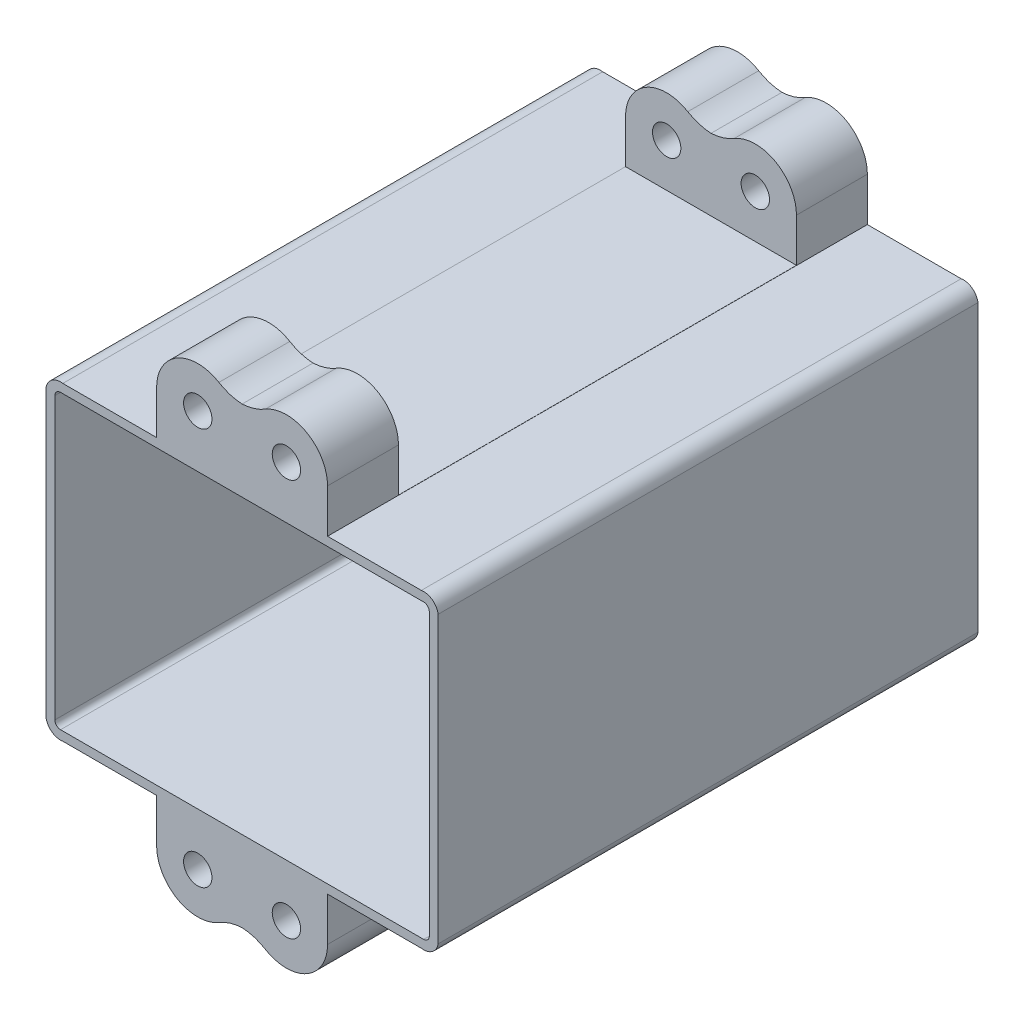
from build123d import *

# Parameters (mm, degrees)
SKETCH1_R          = 1.27
EXTRUDE3_DEPTH     = 48.3362
SKETCH2_W          = 35.6362
SKETCH2_H          = 9.049515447
CUT_EXTRUDE2_DEPTH = 64.48343831


with BuildPart() as part:
    # Sketch1 → Extrude3 (new body)
    with BuildSketch(Plane.XY):
        with BuildLine():
            Line((-17.55775, 12.779375), (-17.55775, -12.779375))
            ThreePointArc((-17.55775, -12.779375), (-17.03054709, -13.639405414), (-16.049625, -13.87475))
            Line((-16.049625, -13.87475), (-7.65175, -13.87475))
            Line((-7.65175, -13.87475), (-7.65175, -17.78))
            ThreePointArc((-7.65175, -17.78), (-5.785304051, -20.983844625), (-2.077696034, -20.940443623))
            ThreePointArc((-2.077696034, -20.940443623), (-1.077511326, -20.495311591), (0, -20.301710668))
            ThreePointArc((0, -20.301710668), (1.077511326, -20.495311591), (2.077696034, -20.940443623))
            ThreePointArc((2.077696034, -20.940443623), (5.785304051, -20.983844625), (7.65175, -17.78))
            Line((7.65175, -17.78), (7.65175, -13.87475))
            Line((7.65175, -13.87475), (16.049625, -13.87475))
            ThreePointArc((16.049625, -13.87475), (17.03054709, -13.639405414), (17.55775, -12.779375))
            Line((17.55775, -12.779375), (17.55775, 12.779375))
            ThreePointArc((17.55775, 12.779375), (17.03054709, 13.639405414), (16.049625, 13.87475))
            Line((16.049625, 13.87475), (7.65175, 13.87475))
            Line((7.65175, 13.87475), (7.65175, 17.78))
            ThreePointArc((7.65175, 17.78), (5.785304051, 20.983844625), (2.077696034, 20.940443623))
            ThreePointArc((2.077696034, 20.940443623), (1.077511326, 20.495311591), (0, 20.301710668))
            ThreePointArc((0, 20.301710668), (-1.077511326, 20.495311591), (-2.077696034, 20.940443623))
            ThreePointArc((-2.077696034, 20.940443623), (-5.785304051, 20.983844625), (-7.65175, 17.78))
            Line((-7.65175, 17.78), (-7.65175, 13.87475))
            Line((-7.65175, 13.87475), (-16.049625, 13.87475))
            ThreePointArc((-16.049625, 13.87475), (-17.03054709, 13.639405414), (-17.55775, 12.779375))
        make_face()
        with Locations(Location((-3.96875, -17.78, 0), (0, 0, 180))):
            Circle(SKETCH1_R, mode=Mode.SUBTRACT)
        with Locations(Location((3.96875, -17.78, 0), (0, 0, 180))):
            Circle(SKETCH1_R, mode=Mode.SUBTRACT)
        with Locations(Location((-3.96875, 17.78, 0), (0, 0, 180))):
            Circle(SKETCH1_R, mode=Mode.SUBTRACT)
        with BuildLine():
            ThreePointArc((-16.764, 12.573), (-16.615210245, 12.932210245), (-16.256, 13.081))
            Line((-16.256, 13.081), (16.256, 13.081))
            ThreePointArc((16.256, 13.081), (16.615210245, 12.932210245), (16.764, 12.573))
            Line((16.764, 12.573), (16.764, -12.573))
            ThreePointArc((16.764, -12.573), (16.615210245, -12.932210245), (16.256, -13.081))
            Line((16.256, -13.081), (-16.256, -13.081))
            ThreePointArc((-16.256, -13.081), (-16.615210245, -12.932210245), (-16.764, -12.573))
            Line((-16.764, -12.573), (-16.764, 12.573))
        make_face(mode=Mode.SUBTRACT)
        with Locations(Location((3.96875, 17.78, 0), (0, 0, 180))):
            Circle(SKETCH1_R, mode=Mode.SUBTRACT)
    extrude(amount=EXTRUDE3_DEPTH)

    # Sketch2 → Cut-Extrude2 (cut, through all)
    with BuildSketch(Plane(origin=(17.55775, 0, 0), x_dir=(0, 0, -1), z_dir=(1, 0, 0))):
        with Locations((-24.1681, 18.415765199)):
            Rectangle(SKETCH2_W, SKETCH2_H)
        with Locations((-24.1681, -18.415765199)):
            Rectangle(SKETCH2_W, SKETCH2_H)
    extrude(amount=-CUT_EXTRUDE2_DEPTH, mode=Mode.SUBTRACT)


solid = part.part
